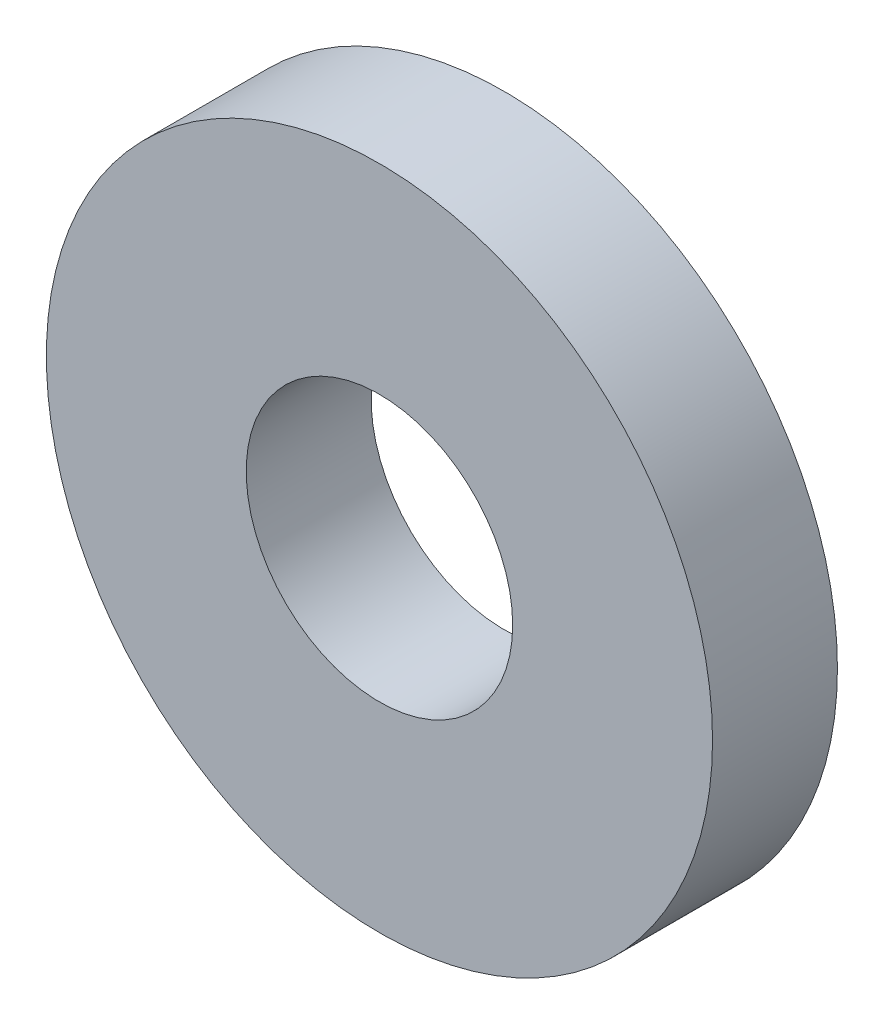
ISO-10303-21;
HEADER;
FILE_DESCRIPTION(('STEP AP214'),'2;1');
FILE_NAME('part.step','',(''),(''),'','','');
FILE_SCHEMA(('AUTOMOTIVE_DESIGN { 1 0 10303 214 1 1 1 1 }'));
ENDSEC;
DATA;
#1=APPLICATION_CONTEXT('core data for automotive mechanical design processes');
#2=APPLICATION_PROTOCOL_DEFINITION('international standard','automotive_design',2000,#1);
#3=PRODUCT_CONTEXT('',#1,'mechanical');
#4=PRODUCT('Part','Part','',(#3));
#5=PRODUCT_RELATED_PRODUCT_CATEGORY('part','',(#4));
#6=PRODUCT_DEFINITION_FORMATION('','',#4);
#7=PRODUCT_DEFINITION_CONTEXT('part definition',#1,'design');
#8=PRODUCT_DEFINITION('design','',#6,#7);
#9=PRODUCT_DEFINITION_SHAPE('','',#8);
#10=(LENGTH_UNIT() NAMED_UNIT(*) SI_UNIT(.MILLI.,.METRE.));
#11=(NAMED_UNIT(*) PLANE_ANGLE_UNIT() SI_UNIT($,.RADIAN.));
#12=(NAMED_UNIT(*) SI_UNIT($,.STERADIAN.) SOLID_ANGLE_UNIT());
#13=UNCERTAINTY_MEASURE_WITH_UNIT(LENGTH_MEASURE(1.E-05),#10,'distance_accuracy_value','');
#14=(GEOMETRIC_REPRESENTATION_CONTEXT(3) GLOBAL_UNCERTAINTY_ASSIGNED_CONTEXT((#13)) GLOBAL_UNIT_ASSIGNED_CONTEXT((#10,
#11,#12)) REPRESENTATION_CONTEXT('',''));
#15=CARTESIAN_POINT('',(0.,0.,0.));
#16=DIRECTION('',(0.,0.,1.));
#17=DIRECTION('',(1.,0.,0.));
#18=AXIS2_PLACEMENT_3D('',#15,#16,#17);
#19=CARTESIAN_POINT('',(0.,0.,1.5));
#20=DIRECTION('',(0.,0.,1.));
#21=DIRECTION('',(1.,0.,0.));
#22=AXIS2_PLACEMENT_3D('',#19,#20,#21);
#23=PLANE('',#22);
#24=CARTESIAN_POINT('',(0.,0.,1.5));
#25=DIRECTION('',(0.,0.,1.));
#26=DIRECTION('',(1.,0.,0.));
#27=AXIS2_PLACEMENT_3D('',#24,#25,#26);
#28=CIRCLE('',#27,4.);
#29=CARTESIAN_POINT('',(4.,0.,1.5));
#30=VERTEX_POINT('',#29);
#31=EDGE_CURVE('E10',#30,#30,#28,.T.);
#32=ORIENTED_EDGE('',*,*,#31,.T.);
#33=EDGE_LOOP('',(#32));
#34=FACE_BOUND('',#33,.T.);
#35=CARTESIAN_POINT('',(0.,0.,1.5));
#36=DIRECTION('',(0.,0.,1.));
#37=DIRECTION('',(1.,0.,0.));
#38=AXIS2_PLACEMENT_3D('',#35,#36,#37);
#39=CIRCLE('',#38,1.6);
#40=CARTESIAN_POINT('',(1.6,0.,1.5));
#41=VERTEX_POINT('',#40);
#42=EDGE_CURVE('E43',#41,#41,#39,.T.);
#43=ORIENTED_EDGE('',*,*,#42,.F.);
#44=EDGE_LOOP('',(#43));
#45=FACE_BOUND('',#44,.T.);
#46=ADVANCED_FACE('F32',(#34,#45),#23,.T.);
#47=CARTESIAN_POINT('',(0.,0.,0.));
#48=DIRECTION('',(0.,0.,1.));
#49=DIRECTION('',(1.,0.,0.));
#50=AXIS2_PLACEMENT_3D('',#47,#48,#49);
#51=PLANE('',#50);
#52=CARTESIAN_POINT('',(0.,0.,0.));
#53=DIRECTION('',(0.,0.,1.));
#54=DIRECTION('',(1.,0.,0.));
#55=AXIS2_PLACEMENT_3D('',#52,#53,#54);
#56=CIRCLE('',#55,4.);
#57=CARTESIAN_POINT('',(4.,0.,0.));
#58=VERTEX_POINT('',#57);
#59=EDGE_CURVE('E36',#58,#58,#56,.T.);
#60=ORIENTED_EDGE('',*,*,#59,.F.);
#61=EDGE_LOOP('',(#60));
#62=FACE_BOUND('',#61,.T.);
#63=CARTESIAN_POINT('',(0.,0.,0.));
#64=DIRECTION('',(0.,0.,1.));
#65=DIRECTION('',(1.,0.,0.));
#66=AXIS2_PLACEMENT_3D('',#63,#64,#65);
#67=CIRCLE('',#66,1.6);
#68=CARTESIAN_POINT('',(1.6,0.,0.));
#69=VERTEX_POINT('',#68);
#70=EDGE_CURVE('E45',#69,#69,#67,.T.);
#71=ORIENTED_EDGE('',*,*,#70,.T.);
#72=EDGE_LOOP('',(#71));
#73=FACE_BOUND('',#72,.T.);
#74=ADVANCED_FACE('F55',(#62,#73),#51,.F.);
#75=CARTESIAN_POINT('',(0.,0.,1.5));
#76=DIRECTION('',(0.,0.,-1.));
#77=DIRECTION('',(-1.,0.,0.));
#78=AXIS2_PLACEMENT_3D('',#75,#76,#77);
#79=CYLINDRICAL_SURFACE('',#78,4.);
#80=ORIENTED_EDGE('',*,*,#31,.F.);
#81=EDGE_LOOP('',(#80));
#82=FACE_BOUND('',#81,.T.);
#83=ORIENTED_EDGE('',*,*,#59,.T.);
#84=EDGE_LOOP('',(#83));
#85=FACE_BOUND('',#84,.T.);
#86=ADVANCED_FACE('F34',(#82,#85),#79,.T.);
#87=CARTESIAN_POINT('',(0.,0.,1.5));
#88=DIRECTION('',(0.,0.,-1.));
#89=DIRECTION('',(-1.,0.,0.));
#90=AXIS2_PLACEMENT_3D('',#87,#88,#89);
#91=CYLINDRICAL_SURFACE('',#90,1.6);
#92=ORIENTED_EDGE('',*,*,#42,.T.);
#93=EDGE_LOOP('',(#92));
#94=FACE_BOUND('',#93,.T.);
#95=ORIENTED_EDGE('',*,*,#70,.F.);
#96=EDGE_LOOP('',(#95));
#97=FACE_BOUND('',#96,.T.);
#98=ADVANCED_FACE('F51',(#94,#97),#91,.F.);
#99=CLOSED_SHELL('',(#46,#74,#86,#98));
#100=MANIFOLD_SOLID_BREP('B2',#99);
#101=ADVANCED_BREP_SHAPE_REPRESENTATION('',(#18,#100),#14);
#102=SHAPE_DEFINITION_REPRESENTATION(#9,#101);
ENDSEC;
END-ISO-10303-21;
